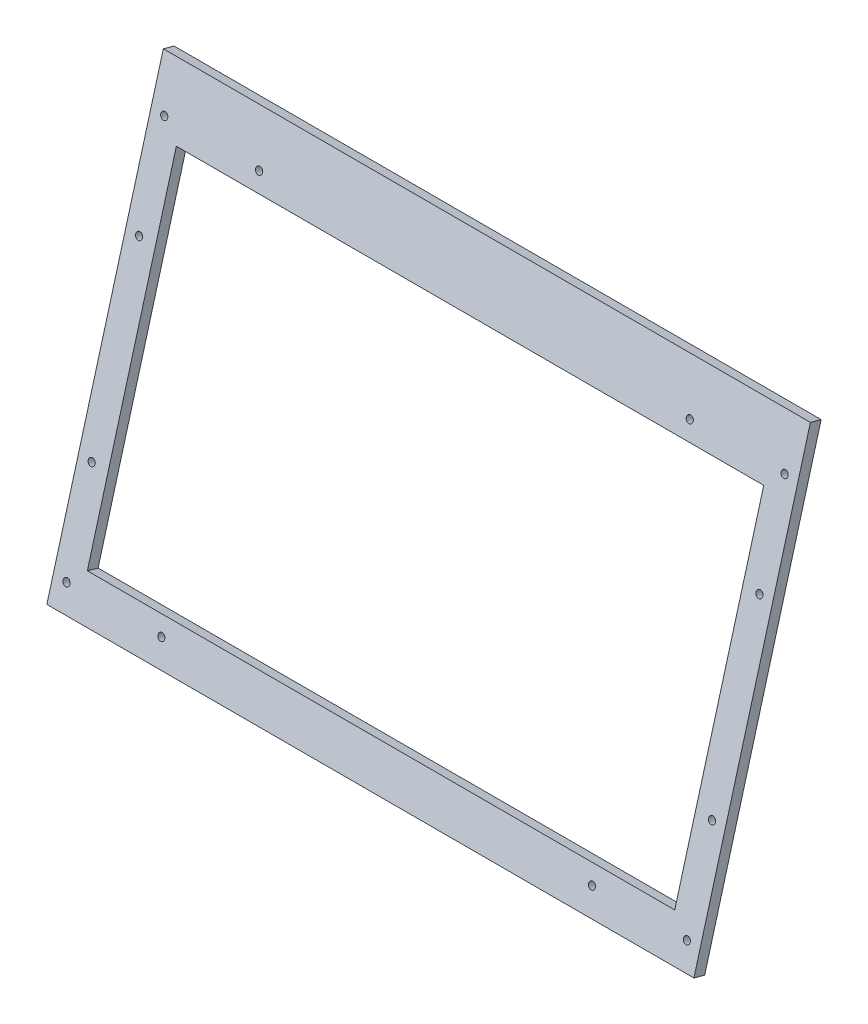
from build123d import *

# Parameters (mm, degrees)
BOSS_EXTRU_3_DEPTH      = 600
ESQUISSE6_W             = 526.5
ESQUISSE6_H             = 300.5
ENL_V_MAT_EXTRU_1_DEPTH = 500
ESQUISSE7_W             = 10
ESQUISSE7_H             = 393.21
ENL_V_MAT_EXTRU_2_DEPTH = 10
ESQUISSE8_R             = 3.1
ENL_V_MAT_EXTRU_3_DEPTH = 10


with BuildPart() as part:
    # Esquisse2 → Boss.-Extru.3 (new body)
    with BuildSketch(Plane(origin=(0, 0, 0), x_dir=(0, 0, -1), z_dir=(1, 0, 0))):
        Polygon((12.126427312, -6.076810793), (-92.272362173, -385.174419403), (-101.913460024, -382.519380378), (2.485329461, -3.421771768), align=None)
    extrude(amount=BOSS_EXTRU_3_DEPTH)

    # Esquisse6 → Enl_v. mat.-Extru.1 (cut)
    with BuildSketch(Plane(origin=(0, -0.877390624, -3.186020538), x_dir=(1, 0, 0), z_dir=(0, 0.26550390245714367, 0.9641097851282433))):
        with Locations((300, -209.639098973)):
            Rectangle(ESQUISSE6_W, ESQUISSE6_H)
    extrude(amount=-ENL_V_MAT_EXTRU_1_DEPTH, mode=Mode.SUBTRACT)

    # Esquisse7 → Enl_v. mat.-Extru.2 (cut)
    with BuildSketch(Plane(origin=(0, -0.877390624, -3.186020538), x_dir=(1, 0, 0), z_dir=(0, 0.26550390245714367, 0.9641097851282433))):
        with Locations((5, -199.244098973)):
            Rectangle(ESQUISSE7_W, ESQUISSE7_H)
        with Locations((595, -199.244098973)):
            Rectangle(ESQUISSE7_W, ESQUISSE7_H)
    extrude(amount=-ENL_V_MAT_EXTRU_2_DEPTH, mode=Mode.SUBTRACT)

    # Esquisse8 → Enl_v. mat.-Extru.3 (cut)
    with BuildSketch(Plane(origin=(0, -3.532429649, -12.827118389), x_dir=(-1, 0, 0), z_dir=(0, -0.26550390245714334, -0.9641097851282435))):
        with Locations(Location((-578, -129.639098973, 0), (0, 0, 90))):
            Circle(ESQUISSE8_R)
        with Locations(Location((-493, -44.639098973, 0), (0, 0, 90))):
            Circle(ESQUISSE8_R)
        with Locations(Location((-578, -289.639098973, 0), (0, 0, 90))):
            Circle(ESQUISSE8_R)
        with Locations(Location((-493, -374.639098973, 0), (0, 0, 90))):
            Circle(ESQUISSE8_R)
        with Locations(Location((-107, -374.639098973, 0), (0, 0, 90))):
            Circle(ESQUISSE8_R)
        with Locations(Location((-22, -289.639098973, 0), (0, 0, 90))):
            Circle(ESQUISSE8_R)
        with Locations(Location((-22, -129.639098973, 0), (0, 0, 90))):
            Circle(ESQUISSE8_R)
        with Locations(Location((-107, -44.639098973, 0), (0, 0, 90))):
            Circle(ESQUISSE8_R)
        with Locations(Location((-578, -44.639098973, 0), (0, 0, 90))):
            Circle(ESQUISSE8_R)
        with Locations(Location((-578, -374.639098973, 0), (0, 0, 90))):
            Circle(ESQUISSE8_R)
        with Locations(Location((-22, -374.639098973, 0), (0, 0, 90))):
            Circle(ESQUISSE8_R)
        with Locations(Location((-22, -44.639098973, 0), (0, 0, 90))):
            Circle(ESQUISSE8_R)
    extrude(amount=-ENL_V_MAT_EXTRU_3_DEPTH, mode=Mode.SUBTRACT)


solid = part.part
